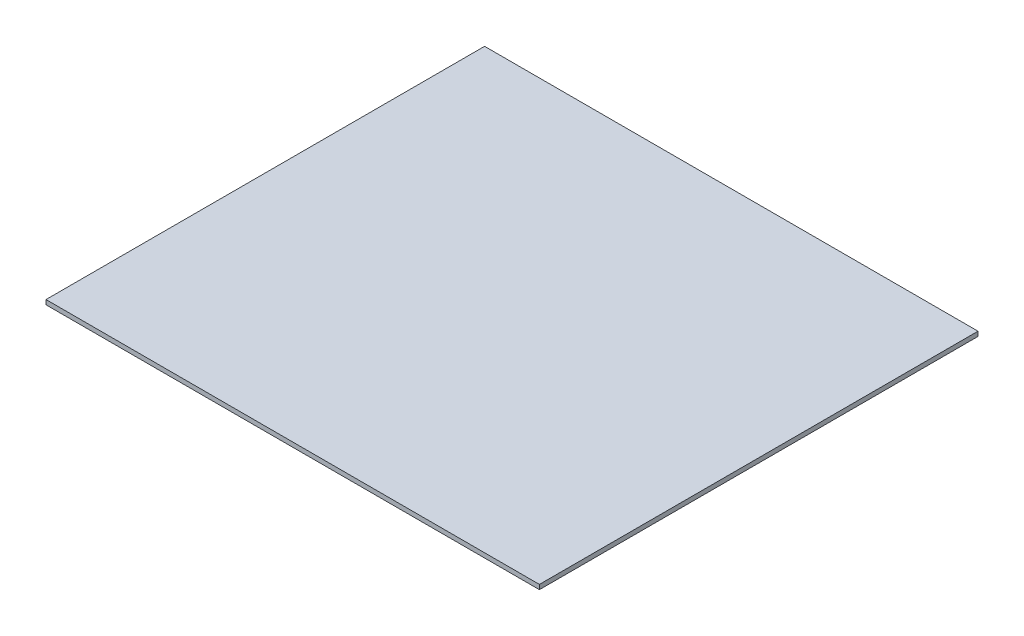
from build123d import *

# Parameters (mm, degrees)
SKETCH1_W      = 1371.6
SKETCH1_H      = 1219.2
EXTRUDE1_DEPTH = 12.7


with BuildPart() as part:
    # Sketch1 → Extrude1 (new body)
    with BuildSketch(Plane(origin=(0, 0, 0), x_dir=(1, 0, 0), z_dir=(0, 1, 0))):
        with Locations((685.8, 609.6)):
            Rectangle(SKETCH1_W, SKETCH1_H)
    extrude(amount=-EXTRUDE1_DEPTH)


solid = part.part
